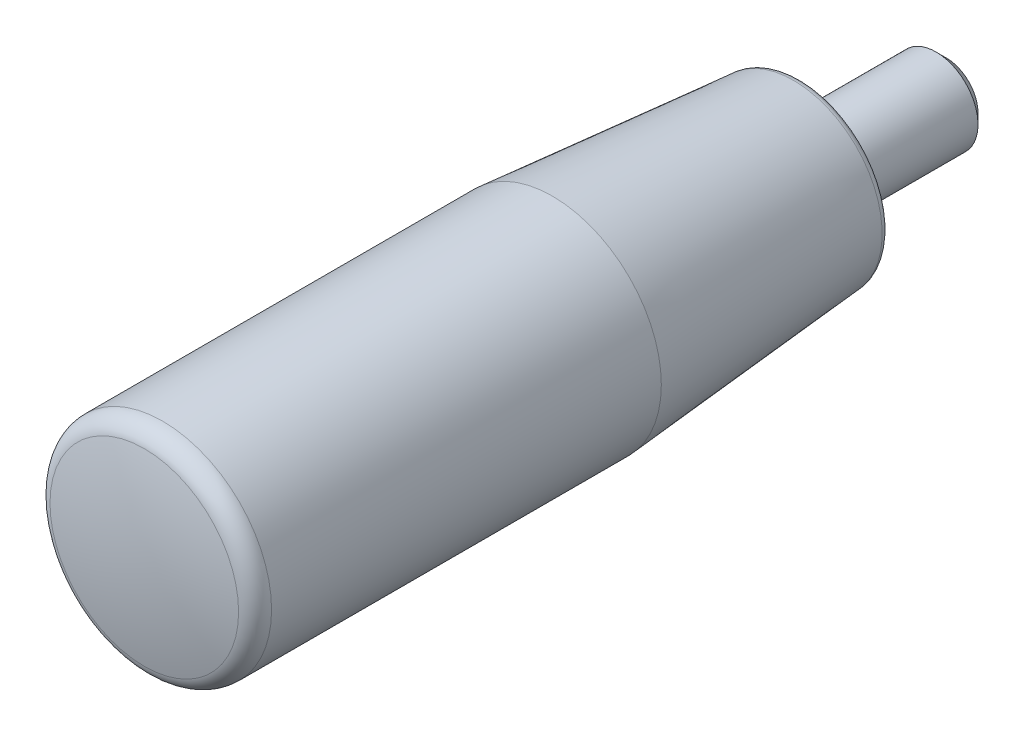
ISO-10303-21;
HEADER;
FILE_DESCRIPTION(('STEP AP214'),'2;1');
FILE_NAME('part.step','',(''),(''),'','','');
FILE_SCHEMA(('AUTOMOTIVE_DESIGN { 1 0 10303 214 1 1 1 1 }'));
ENDSEC;
DATA;
#1=APPLICATION_CONTEXT('core data for automotive mechanical design processes');
#2=APPLICATION_PROTOCOL_DEFINITION('international standard','automotive_design',2000,#1);
#3=PRODUCT_CONTEXT('',#1,'mechanical');
#4=PRODUCT('Part','Part','',(#3));
#5=PRODUCT_RELATED_PRODUCT_CATEGORY('part','',(#4));
#6=PRODUCT_DEFINITION_FORMATION('','',#4);
#7=PRODUCT_DEFINITION_CONTEXT('part definition',#1,'design');
#8=PRODUCT_DEFINITION('design','',#6,#7);
#9=PRODUCT_DEFINITION_SHAPE('','',#8);
#10=(LENGTH_UNIT() NAMED_UNIT(*) SI_UNIT(.MILLI.,.METRE.));
#11=(NAMED_UNIT(*) PLANE_ANGLE_UNIT() SI_UNIT($,.RADIAN.));
#12=(NAMED_UNIT(*) SI_UNIT($,.STERADIAN.) SOLID_ANGLE_UNIT());
#13=UNCERTAINTY_MEASURE_WITH_UNIT(LENGTH_MEASURE(1.E-05),#10,'distance_accuracy_value','');
#14=(GEOMETRIC_REPRESENTATION_CONTEXT(3) GLOBAL_UNCERTAINTY_ASSIGNED_CONTEXT((#13)) GLOBAL_UNIT_ASSIGNED_CONTEXT((#10,
#11,#12)) REPRESENTATION_CONTEXT('',''));
#15=CARTESIAN_POINT('',(0.,0.,0.));
#16=DIRECTION('',(0.,0.,1.));
#17=DIRECTION('',(1.,0.,0.));
#18=AXIS2_PLACEMENT_3D('',#15,#16,#17);
#19=CARTESIAN_POINT('',(0.,0.,76.5241872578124));
#20=DIRECTION('',(0.,0.,-1.));
#21=DIRECTION('',(-1.,0.,0.));
#22=AXIS2_PLACEMENT_3D('',#19,#20,#21);
#23=TOROIDAL_SURFACE('',#22,10.75,2.25);
#24=CARTESIAN_POINT('',(0.,0.,76.5241872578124));
#25=DIRECTION('',(0.,0.,-1.));
#26=DIRECTION('',(-1.,0.,0.));
#27=AXIS2_PLACEMENT_3D('',#24,#25,#26);
#28=CIRCLE('',#27,13.);
#29=CARTESIAN_POINT('',(-13.,0.,76.5241872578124));
#30=VERTEX_POINT('',#29);
#31=EDGE_CURVE('E142',#30,#30,#28,.T.);
#32=ORIENTED_EDGE('',*,*,#31,.F.);
#33=EDGE_LOOP('',(#32));
#34=FACE_BOUND('',#33,.T.);
#35=CARTESIAN_POINT('',(0.,0.,78.7164264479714));
#36=DIRECTION('',(0.,0.,-1.));
#37=DIRECTION('',(-1.,0.,0.));
#38=AXIS2_PLACEMENT_3D('',#35,#36,#37);
#39=CIRCLE('',#38,11.2565445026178);
#40=CARTESIAN_POINT('',(-11.2565445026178,0.,78.7164264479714));
#41=VERTEX_POINT('',#40);
#42=EDGE_CURVE('E116',#41,#41,#39,.T.);
#43=ORIENTED_EDGE('',*,*,#42,.T.);
#44=EDGE_LOOP('',(#43));
#45=FACE_BOUND('',#44,.T.);
#46=ADVANCED_FACE('F14',(#34,#45),#23,.T.);
#47=CARTESIAN_POINT('',(0.,0.,-22.));
#48=DIRECTION('',(0.,0.,-1.));
#49=DIRECTION('',(-1.,0.,0.));
#50=AXIS2_PLACEMENT_3D('',#47,#48,#49);
#51=CYLINDRICAL_SURFACE('',#50,13.);
#52=CARTESIAN_POINT('',(0.,0.,30.));
#53=DIRECTION('',(0.,0.,-1.));
#54=DIRECTION('',(-1.,0.,0.));
#55=AXIS2_PLACEMENT_3D('',#52,#53,#54);
#56=CIRCLE('',#55,13.);
#57=CARTESIAN_POINT('',(-13.,0.,30.));
#58=VERTEX_POINT('',#57);
#59=EDGE_CURVE('E139',#58,#58,#56,.T.);
#60=ORIENTED_EDGE('',*,*,#59,.F.);
#61=EDGE_LOOP('',(#60));
#62=FACE_BOUND('',#61,.T.);
#63=ORIENTED_EDGE('',*,*,#31,.T.);
#64=EDGE_LOOP('',(#63));
#65=FACE_BOUND('',#64,.T.);
#66=ADVANCED_FACE('F161',(#62,#65),#51,.T.);
#67=CARTESIAN_POINT('',(0.,0.,1.21611887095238));
#68=DIRECTION('',(0.,0.,1.));
#69=DIRECTION('',(1.,0.,0.));
#70=AXIS2_PLACEMENT_3D('',#67,#68,#69);
#71=CONICAL_SURFACE('',#70,10.5771143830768,0.0839771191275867);
#72=ORIENTED_EDGE('',*,*,#59,.T.);
#73=EDGE_LOOP('',(#72));
#74=FACE_BOUND('',#73,.T.);
#75=CARTESIAN_POINT('',(0.,0.,1.21611887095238));
#76=DIRECTION('',(0.,0.,-1.));
#77=DIRECTION('',(-1.,0.,0.));
#78=AXIS2_PLACEMENT_3D('',#75,#76,#77);
#79=CIRCLE('',#78,10.5771143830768);
#80=CARTESIAN_POINT('',(-10.5771143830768,0.,1.21611887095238));
#81=VERTEX_POINT('',#80);
#82=EDGE_CURVE('E136',#81,#81,#79,.T.);
#83=ORIENTED_EDGE('',*,*,#82,.F.);
#84=EDGE_LOOP('',(#83));
#85=FACE_BOUND('',#84,.T.);
#86=ADVANCED_FACE('F167',(#74,#85),#71,.T.);
#87=CARTESIAN_POINT('',(0.,0.,1.3));
#88=DIRECTION('',(0.,0.,-1.));
#89=DIRECTION('',(-1.,0.,0.));
#90=AXIS2_PLACEMENT_3D('',#87,#88,#89);
#91=TOROIDAL_SURFACE('',#90,9.58063861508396,1.00000000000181);
#92=CARTESIAN_POINT('',(0.,0.,0.29999999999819));
#93=DIRECTION('',(0.,0.,-1.));
#94=DIRECTION('',(-1.,0.,0.));
#95=AXIS2_PLACEMENT_3D('',#92,#93,#94);
#96=CIRCLE('',#95,9.58063861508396);
#97=CARTESIAN_POINT('',(-9.58063861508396,0.,0.29999999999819));
#98=VERTEX_POINT('',#97);
#99=EDGE_CURVE('E133',#98,#98,#96,.T.);
#100=ORIENTED_EDGE('',*,*,#99,.F.);
#101=EDGE_LOOP('',(#100));
#102=FACE_BOUND('',#101,.T.);
#103=ORIENTED_EDGE('',*,*,#82,.T.);
#104=EDGE_LOOP('',(#103));
#105=FACE_BOUND('',#104,.T.);
#106=ADVANCED_FACE('F175',(#102,#105),#91,.T.);
#107=CARTESIAN_POINT('',(0.,6.,0.299999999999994));
#108=DIRECTION('',(0.,0.,-1.));
#109=DIRECTION('',(-1.,0.,0.));
#110=AXIS2_PLACEMENT_3D('',#107,#108,#109);
#111=PLANE('',#110);
#112=ORIENTED_EDGE('',*,*,#99,.T.);
#113=EDGE_LOOP('',(#112));
#114=FACE_BOUND('',#113,.T.);
#115=CARTESIAN_POINT('',(0.,0.,0.299999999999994));
#116=DIRECTION('',(0.,0.,-1.));
#117=DIRECTION('',(-1.,0.,0.));
#118=AXIS2_PLACEMENT_3D('',#115,#116,#117);
#119=CIRCLE('',#118,6.);
#120=CARTESIAN_POINT('',(-6.,0.,0.299999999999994));
#121=VERTEX_POINT('',#120);
#122=EDGE_CURVE('E130',#121,#121,#119,.T.);
#123=ORIENTED_EDGE('',*,*,#122,.F.);
#124=EDGE_LOOP('',(#123));
#125=FACE_BOUND('',#124,.T.);
#126=ADVANCED_FACE('F179',(#114,#125),#111,.T.);
#127=CARTESIAN_POINT('',(0.,0.,-22.));
#128=DIRECTION('',(0.,0.,-1.));
#129=DIRECTION('',(-1.,0.,0.));
#130=AXIS2_PLACEMENT_3D('',#127,#128,#129);
#131=CYLINDRICAL_SURFACE('',#130,6.);
#132=ORIENTED_EDGE('',*,*,#122,.T.);
#133=EDGE_LOOP('',(#132));
#134=FACE_BOUND('',#133,.T.);
#135=CARTESIAN_POINT('',(0.,0.,0.));
#136=DIRECTION('',(0.,0.,-1.));
#137=DIRECTION('',(-1.,0.,0.));
#138=AXIS2_PLACEMENT_3D('',#135,#136,#137);
#139=CIRCLE('',#138,6.);
#140=CARTESIAN_POINT('',(-6.,0.,0.));
#141=VERTEX_POINT('',#140);
#142=EDGE_CURVE('E127',#141,#141,#139,.T.);
#143=ORIENTED_EDGE('',*,*,#142,.F.);
#144=EDGE_LOOP('',(#143));
#145=FACE_BOUND('',#144,.T.);
#146=ADVANCED_FACE('F183',(#134,#145),#131,.T.);
#147=CARTESIAN_POINT('',(0.,6.,0.));
#148=DIRECTION('',(0.,0.,1.));
#149=DIRECTION('',(1.,0.,0.));
#150=AXIS2_PLACEMENT_3D('',#147,#148,#149);
#151=PLANE('',#150);
#152=CARTESIAN_POINT('',(0.,0.,0.));
#153=DIRECTION('',(0.,0.,-1.));
#154=DIRECTION('',(-1.,0.,0.));
#155=AXIS2_PLACEMENT_3D('',#152,#153,#154);
#156=CIRCLE('',#155,5.);
#157=CARTESIAN_POINT('',(-5.,0.,0.));
#158=VERTEX_POINT('',#157);
#159=EDGE_CURVE('E124',#158,#158,#156,.T.);
#160=ORIENTED_EDGE('',*,*,#159,.F.);
#161=EDGE_LOOP('',(#160));
#162=FACE_BOUND('',#161,.T.);
#163=ORIENTED_EDGE('',*,*,#142,.T.);
#164=EDGE_LOOP('',(#163));
#165=FACE_BOUND('',#164,.T.);
#166=ADVANCED_FACE('F187',(#162,#165),#151,.F.);
#167=CARTESIAN_POINT('',(0.,0.,-22.));
#168=DIRECTION('',(0.,0.,-1.));
#169=DIRECTION('',(-1.,0.,0.));
#170=AXIS2_PLACEMENT_3D('',#167,#168,#169);
#171=CYLINDRICAL_SURFACE('',#170,5.);
#172=CARTESIAN_POINT('',(0.,0.,-15.8));
#173=DIRECTION('',(0.,0.,-1.));
#174=DIRECTION('',(-1.,0.,0.));
#175=AXIS2_PLACEMENT_3D('',#172,#173,#174);
#176=CIRCLE('',#175,5.);
#177=CARTESIAN_POINT('',(-5.,0.,-15.8));
#178=VERTEX_POINT('',#177);
#179=EDGE_CURVE('E9',#178,#178,#176,.F.);
#180=ORIENTED_EDGE('',*,*,#179,.T.);
#181=EDGE_LOOP('',(#180));
#182=FACE_BOUND('',#181,.T.);
#183=ORIENTED_EDGE('',*,*,#159,.T.);
#184=EDGE_LOOP('',(#183));
#185=FACE_BOUND('',#184,.T.);
#186=ADVANCED_FACE('F191',(#182,#185),#171,.T.);
#187=CARTESIAN_POINT('',(0.,0.,-17.));
#188=DIRECTION('',(0.,0.,-1.));
#189=DIRECTION('',(-1.,0.,0.));
#190=AXIS2_PLACEMENT_3D('',#187,#188,#189);
#191=PLANE('',#190);
#192=CARTESIAN_POINT('',(0.,0.,-17.));
#193=DIRECTION('',(0.,0.,-1.));
#194=DIRECTION('',(-1.,0.,0.));
#195=AXIS2_PLACEMENT_3D('',#192,#193,#194);
#196=CIRCLE('',#195,3.8);
#197=CARTESIAN_POINT('',(-3.8,0.,-17.));
#198=VERTEX_POINT('',#197);
#199=EDGE_CURVE('E22',#198,#198,#196,.T.);
#200=ORIENTED_EDGE('',*,*,#199,.T.);
#201=EDGE_LOOP('',(#200));
#202=FACE_BOUND('',#201,.T.);
#203=DIRECTION('',(0.866025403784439,0.5,0.));
#204=VECTOR('',#203,1.);
#205=CARTESIAN_POINT('',(-2.5,1.44337567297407,-17.));
#206=LINE('',#205,#204);
#207=CARTESIAN_POINT('',(-2.5,1.44337567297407,-17.));
#208=VERTEX_POINT('',#207);
#209=CARTESIAN_POINT('',(0.,2.88675134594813,-17.));
#210=VERTEX_POINT('',#209);
#211=EDGE_CURVE('E29',#208,#210,#206,.T.);
#212=ORIENTED_EDGE('',*,*,#211,.F.);
#213=DIRECTION('',(0.,1.,0.));
#214=VECTOR('',#213,1.);
#215=CARTESIAN_POINT('',(-2.5,-1.44337567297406,-17.));
#216=LINE('',#215,#214);
#217=CARTESIAN_POINT('',(-2.5,-1.44337567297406,-17.));
#218=VERTEX_POINT('',#217);
#219=EDGE_CURVE('E112',#218,#208,#216,.T.);
#220=ORIENTED_EDGE('',*,*,#219,.F.);
#221=DIRECTION('',(-0.866025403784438,0.5,0.));
#222=VECTOR('',#221,1.);
#223=CARTESIAN_POINT('',(0.,-2.88675134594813,-17.));
#224=LINE('',#223,#222);
#225=CARTESIAN_POINT('',(0.,-2.88675134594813,-17.));
#226=VERTEX_POINT('',#225);
#227=EDGE_CURVE('E110',#226,#218,#224,.T.);
#228=ORIENTED_EDGE('',*,*,#227,.F.);
#229=DIRECTION('',(-0.866025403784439,-0.5,0.));
#230=VECTOR('',#229,1.);
#231=CARTESIAN_POINT('',(2.5,-1.44337567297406,-17.));
#232=LINE('',#231,#230);
#233=CARTESIAN_POINT('',(2.5,-1.44337567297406,-17.));
#234=VERTEX_POINT('',#233);
#235=EDGE_CURVE('E77',#234,#226,#232,.T.);
#236=ORIENTED_EDGE('',*,*,#235,.F.);
#237=DIRECTION('',(0.,-1.,0.));
#238=VECTOR('',#237,1.);
#239=CARTESIAN_POINT('',(2.5,1.44337567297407,-17.));
#240=LINE('',#239,#238);
#241=CARTESIAN_POINT('',(2.5,1.44337567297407,-17.));
#242=VERTEX_POINT('',#241);
#243=EDGE_CURVE('E106',#242,#234,#240,.T.);
#244=ORIENTED_EDGE('',*,*,#243,.F.);
#245=DIRECTION('',(0.866025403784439,-0.5,0.));
#246=VECTOR('',#245,1.);
#247=CARTESIAN_POINT('',(0.,2.88675134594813,-17.));
#248=LINE('',#247,#246);
#249=EDGE_CURVE('E103',#210,#242,#248,.T.);
#250=ORIENTED_EDGE('',*,*,#249,.F.);
#251=EDGE_LOOP('',(#212,#220,#228,#236,#244,#250));
#252=FACE_BOUND('',#251,.T.);
#253=ADVANCED_FACE('F147',(#202,#252),#191,.T.);
#254=CARTESIAN_POINT('',(0.,0.,30.));
#255=DIRECTION('',(-1.,0.,0.));
#256=DIRECTION('',(0.,0.,1.));
#257=AXIS2_PLACEMENT_3D('',#254,#255,#256);
#258=SPHERICAL_SURFACE('',#257,50.);
#259=CARTESIAN_POINT('',(0.,0.,30.));
#260=DIRECTION('',(0.,0.,-1.));
#261=DIRECTION('',(-1.,0.,0.));
#262=AXIS2_PLACEMENT_3D('',#259,#260,#261);
#263=SPHERICAL_SURFACE('',#262,50.);
#264=ORIENTED_EDGE('',*,*,#42,.F.);
#265=EDGE_LOOP('',(#264));
#266=FACE_BOUND('',#265,.T.);
#267=ADVANCED_FACE('F198',(#266),#263,.T.);
#268=CARTESIAN_POINT('',(-2.5,1.44337567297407,-11.));
#269=DIRECTION('',(-0.5,0.866025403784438,0.));
#270=DIRECTION('',(-0.866025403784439,-0.5,0.));
#271=AXIS2_PLACEMENT_3D('',#268,#269,#270);
#272=PLANE('',#271);
#273=ORIENTED_EDGE('',*,*,#211,.T.);
#274=DIRECTION('',(0.,0.,-1.));
#275=VECTOR('',#274,1.);
#276=CARTESIAN_POINT('',(0.,2.88675134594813,-11.));
#277=LINE('',#276,#275);
#278=CARTESIAN_POINT('',(0.,2.88675134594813,-11.));
#279=VERTEX_POINT('',#278);
#280=EDGE_CURVE('E59',#279,#210,#277,.T.);
#281=ORIENTED_EDGE('',*,*,#280,.F.);
#282=DIRECTION('',(0.866025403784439,0.5,0.));
#283=VECTOR('',#282,1.);
#284=CARTESIAN_POINT('',(-2.5,1.44337567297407,-11.));
#285=LINE('',#284,#283);
#286=CARTESIAN_POINT('',(-2.5,1.44337567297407,-11.));
#287=VERTEX_POINT('',#286);
#288=EDGE_CURVE('E114',#287,#279,#285,.T.);
#289=ORIENTED_EDGE('',*,*,#288,.F.);
#290=DIRECTION('',(0.,0.,-1.));
#291=VECTOR('',#290,1.);
#292=CARTESIAN_POINT('',(-2.5,1.44337567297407,-11.));
#293=LINE('',#292,#291);
#294=EDGE_CURVE('E37',#287,#208,#293,.T.);
#295=ORIENTED_EDGE('',*,*,#294,.T.);
#296=EDGE_LOOP('',(#273,#281,#289,#295));
#297=FACE_BOUND('',#296,.T.);
#298=ADVANCED_FACE('F201',(#297),#272,.F.);
#299=CARTESIAN_POINT('',(-2.5,-1.44337567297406,-11.));
#300=DIRECTION('',(-1.,0.,0.));
#301=DIRECTION('',(0.,0.,1.));
#302=AXIS2_PLACEMENT_3D('',#299,#300,#301);
#303=PLANE('',#302);
#304=ORIENTED_EDGE('',*,*,#219,.T.);
#305=ORIENTED_EDGE('',*,*,#294,.F.);
#306=DIRECTION('',(0.,1.,0.));
#307=VECTOR('',#306,1.);
#308=CARTESIAN_POINT('',(-2.5,-1.44337567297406,-11.));
#309=LINE('',#308,#307);
#310=CARTESIAN_POINT('',(-2.5,-1.44337567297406,-11.));
#311=VERTEX_POINT('',#310);
#312=EDGE_CURVE('E89',#311,#287,#309,.T.);
#313=ORIENTED_EDGE('',*,*,#312,.F.);
#314=DIRECTION('',(0.,0.,-1.));
#315=VECTOR('',#314,1.);
#316=CARTESIAN_POINT('',(-2.5,-1.44337567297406,-11.));
#317=LINE('',#316,#315);
#318=EDGE_CURVE('E81',#311,#218,#317,.T.);
#319=ORIENTED_EDGE('',*,*,#318,.T.);
#320=EDGE_LOOP('',(#304,#305,#313,#319));
#321=FACE_BOUND('',#320,.T.);
#322=ADVANCED_FACE('F205',(#321),#303,.F.);
#323=CARTESIAN_POINT('',(0.,-2.88675134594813,-11.));
#324=DIRECTION('',(-0.5,-0.866025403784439,0.));
#325=DIRECTION('',(0.866025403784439,-0.5,0.));
#326=AXIS2_PLACEMENT_3D('',#323,#324,#325);
#327=PLANE('',#326);
#328=ORIENTED_EDGE('',*,*,#227,.T.);
#329=ORIENTED_EDGE('',*,*,#318,.F.);
#330=DIRECTION('',(-0.866025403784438,0.5,0.));
#331=VECTOR('',#330,1.);
#332=CARTESIAN_POINT('',(0.,-2.88675134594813,-11.));
#333=LINE('',#332,#331);
#334=CARTESIAN_POINT('',(0.,-2.88675134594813,-11.));
#335=VERTEX_POINT('',#334);
#336=EDGE_CURVE('E85',#335,#311,#333,.T.);
#337=ORIENTED_EDGE('',*,*,#336,.F.);
#338=DIRECTION('',(0.,0.,-1.));
#339=VECTOR('',#338,1.);
#340=CARTESIAN_POINT('',(0.,-2.88675134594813,-11.));
#341=LINE('',#340,#339);
#342=EDGE_CURVE('E70',#335,#226,#341,.T.);
#343=ORIENTED_EDGE('',*,*,#342,.T.);
#344=EDGE_LOOP('',(#328,#329,#337,#343));
#345=FACE_BOUND('',#344,.T.);
#346=ADVANCED_FACE('F86',(#345),#327,.F.);
#347=CARTESIAN_POINT('',(2.5,-1.44337567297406,-11.));
#348=DIRECTION('',(0.5,-0.866025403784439,0.));
#349=DIRECTION('',(0.866025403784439,0.5,0.));
#350=AXIS2_PLACEMENT_3D('',#347,#348,#349);
#351=PLANE('',#350);
#352=ORIENTED_EDGE('',*,*,#235,.T.);
#353=ORIENTED_EDGE('',*,*,#342,.F.);
#354=DIRECTION('',(-0.866025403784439,-0.5,0.));
#355=VECTOR('',#354,1.);
#356=CARTESIAN_POINT('',(2.5,-1.44337567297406,-11.));
#357=LINE('',#356,#355);
#358=CARTESIAN_POINT('',(2.5,-1.44337567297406,-11.));
#359=VERTEX_POINT('',#358);
#360=EDGE_CURVE('E74',#359,#335,#357,.T.);
#361=ORIENTED_EDGE('',*,*,#360,.F.);
#362=DIRECTION('',(0.,0.,-1.));
#363=VECTOR('',#362,1.);
#364=CARTESIAN_POINT('',(2.5,-1.44337567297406,-11.));
#365=LINE('',#364,#363);
#366=EDGE_CURVE('E82',#359,#234,#365,.T.);
#367=ORIENTED_EDGE('',*,*,#366,.T.);
#368=EDGE_LOOP('',(#352,#353,#361,#367));
#369=FACE_BOUND('',#368,.T.);
#370=ADVANCED_FACE('F72',(#369),#351,.F.);
#371=CARTESIAN_POINT('',(2.5,1.44337567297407,-11.));
#372=DIRECTION('',(1.,0.,0.));
#373=DIRECTION('',(0.,1.,0.));
#374=AXIS2_PLACEMENT_3D('',#371,#372,#373);
#375=PLANE('',#374);
#376=ORIENTED_EDGE('',*,*,#243,.T.);
#377=ORIENTED_EDGE('',*,*,#366,.F.);
#378=DIRECTION('',(0.,-1.,0.));
#379=VECTOR('',#378,1.);
#380=CARTESIAN_POINT('',(2.5,1.44337567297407,-11.));
#381=LINE('',#380,#379);
#382=CARTESIAN_POINT('',(2.5,1.44337567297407,-11.));
#383=VERTEX_POINT('',#382);
#384=EDGE_CURVE('E95',#383,#359,#381,.T.);
#385=ORIENTED_EDGE('',*,*,#384,.F.);
#386=DIRECTION('',(0.,0.,-1.));
#387=VECTOR('',#386,1.);
#388=CARTESIAN_POINT('',(2.5,1.44337567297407,-11.));
#389=LINE('',#388,#387);
#390=EDGE_CURVE('E119',#383,#242,#389,.T.);
#391=ORIENTED_EDGE('',*,*,#390,.T.);
#392=EDGE_LOOP('',(#376,#377,#385,#391));
#393=FACE_BOUND('',#392,.T.);
#394=ADVANCED_FACE('F208',(#393),#375,.F.);
#395=CARTESIAN_POINT('',(0.,2.88675134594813,-11.));
#396=DIRECTION('',(0.5,0.866025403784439,0.));
#397=DIRECTION('',(-0.866025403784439,0.5,0.));
#398=AXIS2_PLACEMENT_3D('',#395,#396,#397);
#399=PLANE('',#398);
#400=ORIENTED_EDGE('',*,*,#249,.T.);
#401=ORIENTED_EDGE('',*,*,#390,.F.);
#402=DIRECTION('',(0.866025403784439,-0.5,0.));
#403=VECTOR('',#402,1.);
#404=CARTESIAN_POINT('',(0.,2.88675134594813,-11.));
#405=LINE('',#404,#403);
#406=EDGE_CURVE('E97',#279,#383,#405,.T.);
#407=ORIENTED_EDGE('',*,*,#406,.F.);
#408=ORIENTED_EDGE('',*,*,#280,.T.);
#409=EDGE_LOOP('',(#400,#401,#407,#408));
#410=FACE_BOUND('',#409,.T.);
#411=ADVANCED_FACE('F157',(#410),#399,.F.);
#412=CARTESIAN_POINT('',(0.,2.88675134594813,-11.));
#413=DIRECTION('',(0.,0.,-1.));
#414=DIRECTION('',(-1.,0.,0.));
#415=AXIS2_PLACEMENT_3D('',#412,#413,#414);
#416=PLANE('',#415);
#417=ORIENTED_EDGE('',*,*,#288,.T.);
#418=ORIENTED_EDGE('',*,*,#406,.T.);
#419=ORIENTED_EDGE('',*,*,#384,.T.);
#420=ORIENTED_EDGE('',*,*,#360,.T.);
#421=ORIENTED_EDGE('',*,*,#336,.T.);
#422=ORIENTED_EDGE('',*,*,#312,.T.);
#423=EDGE_LOOP('',(#417,#418,#419,#420,#421,#422));
#424=FACE_BOUND('',#423,.T.);
#425=ADVANCED_FACE('F92',(#424),#416,.T.);
#426=CARTESIAN_POINT('',(0.,0.,-17.));
#427=DIRECTION('',(0.,0.,1.));
#428=DIRECTION('',(1.,0.,0.));
#429=AXIS2_PLACEMENT_3D('',#426,#427,#428);
#430=CONICAL_SURFACE('',#429,3.8,0.785398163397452);
#431=ORIENTED_EDGE('',*,*,#179,.F.);
#432=EDGE_LOOP('',(#431));
#433=FACE_BOUND('',#432,.T.);
#434=ORIENTED_EDGE('',*,*,#199,.F.);
#435=EDGE_LOOP('',(#434));
#436=FACE_BOUND('',#435,.T.);
#437=ADVANCED_FACE('F16',(#433,#436),#430,.T.);
#438=CLOSED_SHELL('',(#46,#66,#86,#106,#126,#146,#166,#186,#253,#267,#298,#322,#346,#370,#394,
#411,#425,#437));
#439=MANIFOLD_SOLID_BREP('B1',#438);
#440=ADVANCED_BREP_SHAPE_REPRESENTATION('',(#18,#439),#14);
#441=SHAPE_DEFINITION_REPRESENTATION(#9,#440);
ENDSEC;
END-ISO-10303-21;
